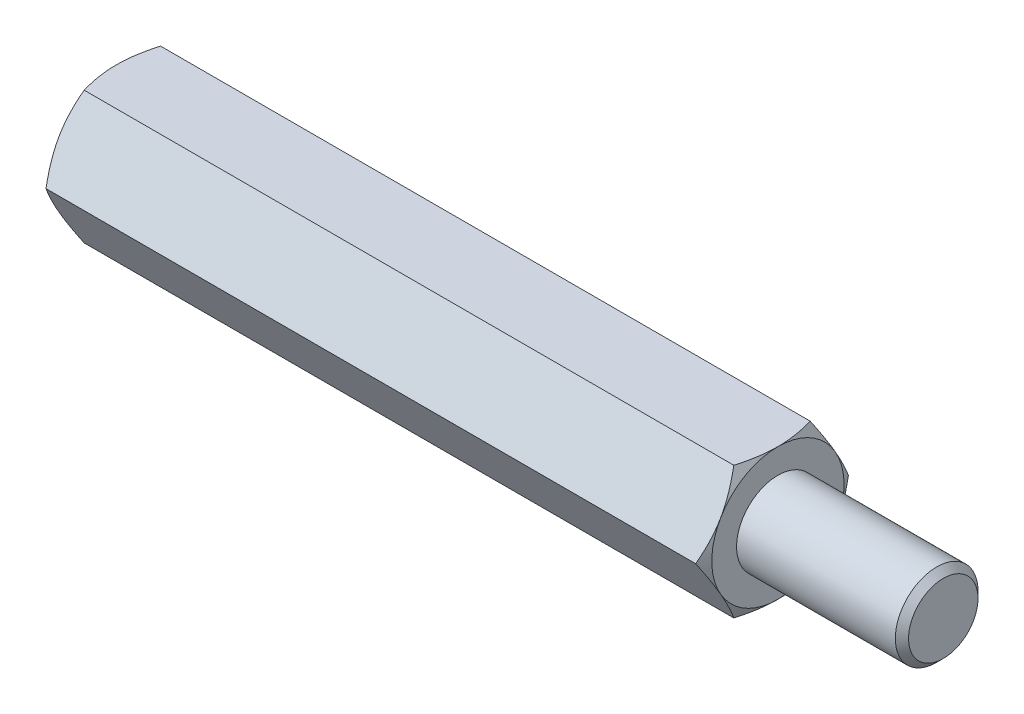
ISO-10303-21;
HEADER;
FILE_DESCRIPTION(('STEP AP214'),'2;1');
FILE_NAME('part.step','',(''),(''),'','','');
FILE_SCHEMA(('AUTOMOTIVE_DESIGN { 1 0 10303 214 1 1 1 1 }'));
ENDSEC;
DATA;
#1=APPLICATION_CONTEXT('core data for automotive mechanical design processes');
#2=APPLICATION_PROTOCOL_DEFINITION('international standard','automotive_design',2000,#1);
#3=PRODUCT_CONTEXT('',#1,'mechanical');
#4=PRODUCT('Part','Part','',(#3));
#5=PRODUCT_RELATED_PRODUCT_CATEGORY('part','',(#4));
#6=PRODUCT_DEFINITION_FORMATION('','',#4);
#7=PRODUCT_DEFINITION_CONTEXT('part definition',#1,'design');
#8=PRODUCT_DEFINITION('design','',#6,#7);
#9=PRODUCT_DEFINITION_SHAPE('','',#8);
#10=(LENGTH_UNIT() NAMED_UNIT(*) SI_UNIT(.MILLI.,.METRE.));
#11=(NAMED_UNIT(*) PLANE_ANGLE_UNIT() SI_UNIT($,.RADIAN.));
#12=(NAMED_UNIT(*) SI_UNIT($,.STERADIAN.) SOLID_ANGLE_UNIT());
#13=UNCERTAINTY_MEASURE_WITH_UNIT(LENGTH_MEASURE(1.E-05),#10,'distance_accuracy_value','');
#14=(GEOMETRIC_REPRESENTATION_CONTEXT(3) GLOBAL_UNCERTAINTY_ASSIGNED_CONTEXT((#13)) GLOBAL_UNIT_ASSIGNED_CONTEXT((#10,
#11,#12)) REPRESENTATION_CONTEXT('',''));
#15=CARTESIAN_POINT('',(0.,0.,0.));
#16=DIRECTION('',(0.,0.,1.));
#17=DIRECTION('',(1.,0.,0.));
#18=AXIS2_PLACEMENT_3D('',#15,#16,#17);
#19=CARTESIAN_POINT('',(20.,4.,-2.3094010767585));
#20=DIRECTION('',(1.,0.,0.));
#21=DIRECTION('',(0.,0.,-1.));
#22=AXIS2_PLACEMENT_3D('',#19,#20,#21);
#23=PLANE('',#22);
#24=CARTESIAN_POINT('',(20.,0.,0.));
#25=DIRECTION('',(1.,0.,0.));
#26=DIRECTION('',(0.,0.,-1.));
#27=AXIS2_PLACEMENT_3D('',#24,#25,#26);
#28=CIRCLE('',#27,4.);
#29=CARTESIAN_POINT('',(20.,-2.,-3.46410161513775));
#30=VERTEX_POINT('',#29);
#31=CARTESIAN_POINT('',(20.,2.,-3.46410161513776));
#32=VERTEX_POINT('',#31);
#33=EDGE_CURVE('E288',#30,#32,#28,.T.);
#34=ORIENTED_EDGE('',*,*,#33,.T.);
#35=CARTESIAN_POINT('',(20.,4.,0.));
#36=VERTEX_POINT('',#35);
#37=EDGE_CURVE('E53',#32,#36,#28,.T.);
#38=ORIENTED_EDGE('',*,*,#37,.T.);
#39=CARTESIAN_POINT('',(20.,2.,3.46410161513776));
#40=VERTEX_POINT('',#39);
#41=EDGE_CURVE('E297',#36,#40,#28,.T.);
#42=ORIENTED_EDGE('',*,*,#41,.T.);
#43=CARTESIAN_POINT('',(20.,-2.00000000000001,3.46410161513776));
#44=VERTEX_POINT('',#43);
#45=EDGE_CURVE('E302',#40,#44,#28,.T.);
#46=ORIENTED_EDGE('',*,*,#45,.T.);
#47=CARTESIAN_POINT('',(20.,0.,0.));
#48=DIRECTION('',(-1.,0.,0.));
#49=DIRECTION('',(0.,-1.,0.));
#50=AXIS2_PLACEMENT_3D('',#47,#48,#49);
#51=CIRCLE('',#50,4.);
#52=CARTESIAN_POINT('',(20.,-4.00000000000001,0.));
#53=VERTEX_POINT('',#52);
#54=EDGE_CURVE('E193',#53,#44,#51,.T.);
#55=ORIENTED_EDGE('',*,*,#54,.F.);
#56=EDGE_CURVE('E61',#53,#30,#28,.T.);
#57=ORIENTED_EDGE('',*,*,#56,.T.);
#58=EDGE_LOOP('',(#34,#38,#42,#46,#55,#57));
#59=FACE_BOUND('',#58,.T.);
#60=CARTESIAN_POINT('',(20.,0.,0.));
#61=DIRECTION('',(1.,0.,0.));
#62=DIRECTION('',(0.,0.,-1.));
#63=AXIS2_PLACEMENT_3D('',#60,#61,#62);
#64=CIRCLE('',#63,2.5);
#65=CARTESIAN_POINT('',(20.,0.,-2.5));
#66=VERTEX_POINT('',#65);
#67=EDGE_CURVE('E356',#66,#66,#64,.T.);
#68=ORIENTED_EDGE('',*,*,#67,.F.);
#69=EDGE_LOOP('',(#68));
#70=FACE_BOUND('',#69,.T.);
#71=ADVANCED_FACE('F37',(#59,#70),#23,.T.);
#72=CARTESIAN_POINT('',(20.,0.,-4.61880215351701));
#73=DIRECTION('',(0.,-0.5,0.866025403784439));
#74=DIRECTION('',(0.,-0.866025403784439,-0.5));
#75=AXIS2_PLACEMENT_3D('',#72,#73,#74);
#76=PLANE('',#75);
#77=CARTESIAN_POINT('',(19.6426677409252,-0.000200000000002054,-4.61891762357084));
#78=CARTESIAN_POINT('',(19.7012821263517,0.175579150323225,-4.51743148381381));
#79=CARTESIAN_POINT('',(19.7545896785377,0.352875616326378,-4.41506932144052));
#80=CARTESIAN_POINT('',(19.8476383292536,0.710538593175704,-4.20857250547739));
#81=CARTESIAN_POINT('',(19.8873465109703,0.890911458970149,-4.10443418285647));
#82=CARTESIAN_POINT('',(19.9491577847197,1.24942181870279,-3.89744813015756));
#83=CARTESIAN_POINT('',(19.9716722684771,1.42750415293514,-3.79463224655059));
#84=CARTESIAN_POINT('',(19.9985493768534,1.78450671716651,-3.58851671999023));
#85=CARTESIAN_POINT('',(20.0029342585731,1.9634256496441,-3.48521782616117));
#86=CARTESIAN_POINT('',(19.99380992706,2.29774284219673,-3.29219970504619));
#87=CARTESIAN_POINT('',(19.982541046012,2.45319115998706,-3.20245157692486));
#88=CARTESIAN_POINT('',(19.9468260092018,2.76307505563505,-3.02354002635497));
#89=CARTESIAN_POINT('',(19.9223676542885,2.91750956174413,-2.93437722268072));
#90=CARTESIAN_POINT('',(19.8612239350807,3.22803232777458,-2.75509682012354));
#91=CARTESIAN_POINT('',(19.8242793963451,3.3840812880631,-2.6650019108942));
#92=CARTESIAN_POINT('',(19.740429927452,3.69385183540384,-2.486155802));
#93=CARTESIAN_POINT('',(19.6935446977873,3.84757739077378,-2.39740231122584));
#94=CARTESIAN_POINT('',(19.6426677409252,4.0002,-2.30928560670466));
#95=B_SPLINE_CURVE_WITH_KNOTS('',3,(#77,#78,#79,#80,#81,#82,#83,#84,#85,#86,#87,#88,#89,#90,#91,
#92,#93,#94),.UNSPECIFIED.,.F.,.F.,(4,2,2,2,2,2,2,2,4),(0.,0.634047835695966,1.26961969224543,
1.88946157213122,2.50854226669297,3.04757825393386,3.58711366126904,4.13861653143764,
4.68903648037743),.UNSPECIFIED.);
#96=CARTESIAN_POINT('',(19.6427344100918,0.,-4.61880215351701));
#97=VERTEX_POINT('',#96);
#98=EDGE_CURVE('E314',#97,#32,#95,.T.);
#99=ORIENTED_EDGE('',*,*,#98,.F.);
#100=DIRECTION('',(-1.,0.,0.));
#101=VECTOR('',#100,1.);
#102=CARTESIAN_POINT('',(20.,0.,-4.61880215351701));
#103=LINE('',#102,#101);
#104=CARTESIAN_POINT('',(-19.6427344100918,0.,-4.61880215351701));
#105=VERTEX_POINT('',#104);
#106=EDGE_CURVE('E264',#97,#105,#103,.T.);
#107=ORIENTED_EDGE('',*,*,#106,.T.);
#108=CARTESIAN_POINT('',(-19.6426677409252,4.0002,-2.30928560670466));
#109=CARTESIAN_POINT('',(-19.7012821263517,3.82442084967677,-2.4107717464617));
#110=CARTESIAN_POINT('',(-19.7545896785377,3.64712438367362,-2.51313390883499));
#111=CARTESIAN_POINT('',(-19.8476383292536,3.28946140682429,-2.71963072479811));
#112=CARTESIAN_POINT('',(-19.8873465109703,3.10908854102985,-2.82376904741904));
#113=CARTESIAN_POINT('',(-19.9491577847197,2.75057818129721,-3.03075510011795));
#114=CARTESIAN_POINT('',(-19.9716722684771,2.57249584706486,-3.13357098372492));
#115=CARTESIAN_POINT('',(-19.9985493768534,2.21549328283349,-3.33968651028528));
#116=CARTESIAN_POINT('',(-20.0029342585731,2.0365743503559,-3.44298540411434));
#117=CARTESIAN_POINT('',(-19.99380992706,1.70225715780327,-3.63600352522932));
#118=CARTESIAN_POINT('',(-19.982541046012,1.54680884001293,-3.72575165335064));
#119=CARTESIAN_POINT('',(-19.9468260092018,1.23692494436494,-3.90466320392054));
#120=CARTESIAN_POINT('',(-19.9223676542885,1.08249043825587,-3.99382600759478));
#121=CARTESIAN_POINT('',(-19.8612239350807,0.77196767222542,-4.17310641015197));
#122=CARTESIAN_POINT('',(-19.8242793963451,0.615918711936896,-4.26320131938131));
#123=CARTESIAN_POINT('',(-19.740429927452,0.306148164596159,-4.4420474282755));
#124=CARTESIAN_POINT('',(-19.6935446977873,0.152422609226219,-4.53080091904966));
#125=CARTESIAN_POINT('',(-19.6426677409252,-0.000200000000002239,-4.61891762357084));
#126=B_SPLINE_CURVE_WITH_KNOTS('',3,(#108,#109,#110,#111,#112,#113,#114,#115,#116,#117,#118,
#119,#120,#121,#122,#123,#124,#125),.UNSPECIFIED.,.F.,.F.,(4,2,2,2,2,2,2,2,4),(0.,
0.634047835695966,1.26961969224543,1.88946157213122,2.50854226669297,3.04757825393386,
3.58711366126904,4.13861653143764,4.68903648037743),.UNSPECIFIED.);
#127=CARTESIAN_POINT('',(-20.,2.,-3.46410161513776));
#128=VERTEX_POINT('',#127);
#129=EDGE_CURVE('E365',#128,#105,#126,.T.);
#130=ORIENTED_EDGE('',*,*,#129,.F.);
#131=CARTESIAN_POINT('',(-19.6427344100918,4.,-2.3094010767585));
#132=VERTEX_POINT('',#131);
#133=EDGE_CURVE('E391',#132,#128,#126,.T.);
#134=ORIENTED_EDGE('',*,*,#133,.F.);
#135=DIRECTION('',(-1.,0.,0.));
#136=VECTOR('',#135,1.);
#137=CARTESIAN_POINT('',(20.,4.,-2.3094010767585));
#138=LINE('',#137,#136);
#139=CARTESIAN_POINT('',(19.642734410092,4.,-2.30940107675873));
#140=VERTEX_POINT('',#139);
#141=EDGE_CURVE('E279',#140,#132,#138,.T.);
#142=ORIENTED_EDGE('',*,*,#141,.F.);
#143=EDGE_CURVE('E229',#32,#140,#95,.T.);
#144=ORIENTED_EDGE('',*,*,#143,.F.);
#145=EDGE_LOOP('',(#99,#107,#130,#134,#142,#144));
#146=FACE_BOUND('',#145,.T.);
#147=ADVANCED_FACE('F148',(#146),#76,.F.);
#148=CARTESIAN_POINT('',(20.,4.,-2.3094010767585));
#149=DIRECTION('',(0.,-1.,0.));
#150=DIRECTION('',(0.,0.,-1.));
#151=AXIS2_PLACEMENT_3D('',#148,#149,#150);
#152=PLANE('',#151);
#153=CARTESIAN_POINT('',(18.0082907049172,4.,-6.28479524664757));
#154=CARTESIAN_POINT('',(18.0937006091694,4.,-6.10939349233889));
#155=CARTESIAN_POINT('',(18.1783148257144,4.,-5.93359774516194));
#156=CARTESIAN_POINT('',(18.3455059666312,4.,-5.58100905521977));
#157=CARTESIAN_POINT('',(18.4280825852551,4.,-5.40421596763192));
#158=CARTESIAN_POINT('',(18.5911508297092,4.,-5.04855089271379));
#159=CARTESIAN_POINT('',(18.6716293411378,4.,-4.86967287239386));
#160=CARTESIAN_POINT('',(18.829400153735,4.,-4.51052237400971));
#161=CARTESIAN_POINT('',(18.906692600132,4.,-4.33024995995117));
#162=CARTESIAN_POINT('',(19.059802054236,4.,-3.96189114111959));
#163=CARTESIAN_POINT('',(19.135480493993,4.,-3.77374683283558));
#164=CARTESIAN_POINT('',(19.2813045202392,4.,-3.39528725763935));
#165=CARTESIAN_POINT('',(19.3514494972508,4.,-3.2049717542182));
#166=CARTESIAN_POINT('',(19.4844245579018,4.,-2.82219775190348));
#167=CARTESIAN_POINT('',(19.5472687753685,4.,-2.62974421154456));
#168=CARTESIAN_POINT('',(19.6636796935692,4.,-2.24207725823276));
#169=CARTESIAN_POINT('',(19.7172492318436,4.,-2.04686470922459));
#170=CARTESIAN_POINT('',(19.8123031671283,4.,-1.65467425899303));
#171=CARTESIAN_POINT('',(19.8538563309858,4.,-1.45771333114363));
#172=CARTESIAN_POINT('',(19.9225903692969,4.,-1.06125849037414));
#173=CARTESIAN_POINT('',(19.9497727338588,4.,-0.861764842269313));
#174=CARTESIAN_POINT('',(19.9872447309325,4.,-0.463879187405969));
#175=CARTESIAN_POINT('',(19.9977578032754,4.,-0.265508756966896));
#176=CARTESIAN_POINT('',(20.0015934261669,4.,0.131417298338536));
#177=CARTESIAN_POINT('',(19.9949158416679,4.,0.329972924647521));
#178=CARTESIAN_POINT('',(19.9696489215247,4.,0.664692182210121));
#179=CARTESIAN_POINT('',(19.9553708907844,4.,0.801202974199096));
#180=CARTESIAN_POINT('',(19.9195349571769,4.,1.07327201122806));
#181=CARTESIAN_POINT('',(19.8979761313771,4.,1.20883013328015));
#182=CARTESIAN_POINT('',(19.8235066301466,4.,1.61386939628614));
#183=CARTESIAN_POINT('',(19.7608149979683,4.,1.8815748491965));
#184=CARTESIAN_POINT('',(19.6515117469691,4.,2.28197262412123));
#185=CARTESIAN_POINT('',(19.612009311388,4.,2.41672443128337));
#186=CARTESIAN_POINT('',(19.5287523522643,4.,2.68492067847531));
#187=CARTESIAN_POINT('',(19.4849977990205,4.,2.81836510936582));
#188=CARTESIAN_POINT('',(19.3939510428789,4.,3.08398596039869));
#189=CARTESIAN_POINT('',(19.346659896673,4.,3.21616274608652));
#190=CARTESIAN_POINT('',(19.2491111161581,4.,3.47941134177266));
#191=CARTESIAN_POINT('',(19.1988535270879,4.,3.61048316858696));
#192=CARTESIAN_POINT('',(19.0713295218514,4.,3.93385125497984));
#193=CARTESIAN_POINT('',(18.9926014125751,4.,4.1255702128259));
#194=CARTESIAN_POINT('',(18.8309693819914,4.,4.5072455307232));
#195=CARTESIAN_POINT('',(18.7480651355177,4.,4.69720175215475));
#196=CARTESIAN_POINT('',(18.5789699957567,4.,5.0756995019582));
#197=CARTESIAN_POINT('',(18.4927782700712,4.,5.264240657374));
#198=CARTESIAN_POINT('',(18.3178011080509,4.,5.64011758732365));
#199=CARTESIAN_POINT('',(18.2290156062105,4.,5.82745333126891));
#200=CARTESIAN_POINT('',(17.9593432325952,4.,6.38844423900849));
#201=CARTESIAN_POINT('',(17.7753561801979,4.,6.76060781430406));
#202=CARTESIAN_POINT('',(17.4019562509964,4.,7.50211228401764));
#203=CARTESIAN_POINT('',(17.2125442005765,4.,7.87145359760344));
#204=CARTESIAN_POINT('',(16.8473877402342,4.,8.57450173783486));
#205=CARTESIAN_POINT('',(16.671975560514,4.,8.90838144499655));
#206=CARTESIAN_POINT('',(16.3188097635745,4.,9.57491712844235));
#207=CARTESIAN_POINT('',(16.1410560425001,4.,9.9075730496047));
#208=CARTESIAN_POINT('',(15.7842933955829,4.,10.5709822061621));
#209=CARTESIAN_POINT('',(15.605289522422,3.99999999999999,10.9017381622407));
#210=CARTESIAN_POINT('',(15.2459071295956,3.99999999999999,11.5624752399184));
#211=CARTESIAN_POINT('',(15.0655286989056,3.99999999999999,11.8924564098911));
#212=CARTESIAN_POINT('',(14.884642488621,3.99999999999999,12.2221569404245));
#213=B_SPLINE_CURVE_WITH_KNOTS('',3,(#153,#154,#155,#156,#157,#158,#159,#160,#161,#162,#163,
#164,#165,#166,#167,#168,#169,#170,#171,#172,#173,#174,#175,#176,#177,#178,#179,#180,#181,#182,
#183,#184,#185,#186,#187,#188,#189,#190,#191,#192,#193,#194,#195,#196,#197,#198,#199,#200,#201,
#202,#203,#204,#205,#206,#207,#208,#209,#210,#211,#212),.UNSPECIFIED.,.F.,.F.,(4,2,2,2,2,2,2,2,
2,2,2,2,2,2,2,2,2,2,2,2,2,2,2,2,2,2,2,2,2,4),(0.,0.585280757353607,1.17064881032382,
1.75906864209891,2.34746162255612,2.95577704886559,3.56415938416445,4.17134357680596,
4.7783416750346,5.38179402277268,5.98518378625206,6.58041501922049,7.17565092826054,
7.5872191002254,7.99883946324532,8.82250155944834,9.24373134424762,9.66496407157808,
10.086071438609,10.5071723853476,11.1288656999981,11.7506074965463,12.3725077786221,
12.9944237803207,14.2398211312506,15.4850297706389,16.6164791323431,17.7479788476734,
18.8762380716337,20.0044248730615),.UNSPECIFIED.);
#214=EDGE_CURVE('E227',#140,#36,#213,.T.);
#215=ORIENTED_EDGE('',*,*,#214,.F.);
#216=ORIENTED_EDGE('',*,*,#141,.T.);
#217=CARTESIAN_POINT('',(-18.0082907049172,4.,-6.28479524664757));
#218=CARTESIAN_POINT('',(-18.0937006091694,4.,-6.10939349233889));
#219=CARTESIAN_POINT('',(-18.1783148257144,4.,-5.93359774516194));
#220=CARTESIAN_POINT('',(-18.3455059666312,4.,-5.58100905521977));
#221=CARTESIAN_POINT('',(-18.4280825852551,4.,-5.40421596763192));
#222=CARTESIAN_POINT('',(-18.5911508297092,4.,-5.04855089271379));
#223=CARTESIAN_POINT('',(-18.6716293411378,4.,-4.86967287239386));
#224=CARTESIAN_POINT('',(-18.829400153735,4.,-4.51052237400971));
#225=CARTESIAN_POINT('',(-18.906692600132,4.,-4.33024995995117));
#226=CARTESIAN_POINT('',(-19.059802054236,4.,-3.96189114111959));
#227=CARTESIAN_POINT('',(-19.135480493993,4.,-3.77374683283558));
#228=CARTESIAN_POINT('',(-19.2813045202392,4.,-3.39528725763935));
#229=CARTESIAN_POINT('',(-19.3514494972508,4.,-3.2049717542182));
#230=CARTESIAN_POINT('',(-19.4844245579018,4.,-2.82219775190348));
#231=CARTESIAN_POINT('',(-19.5472687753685,4.,-2.62974421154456));
#232=CARTESIAN_POINT('',(-19.6636796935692,4.,-2.24207725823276));
#233=CARTESIAN_POINT('',(-19.7172492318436,4.,-2.04686470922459));
#234=CARTESIAN_POINT('',(-19.8123031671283,4.,-1.65467425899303));
#235=CARTESIAN_POINT('',(-19.8538563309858,4.,-1.45771333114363));
#236=CARTESIAN_POINT('',(-19.9225903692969,4.,-1.06125849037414));
#237=CARTESIAN_POINT('',(-19.9497727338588,4.,-0.861764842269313));
#238=CARTESIAN_POINT('',(-19.9872447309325,4.,-0.463879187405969));
#239=CARTESIAN_POINT('',(-19.9977578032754,4.,-0.265508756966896));
#240=CARTESIAN_POINT('',(-20.0015934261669,4.,0.131417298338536));
#241=CARTESIAN_POINT('',(-19.9949158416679,4.,0.329972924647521));
#242=CARTESIAN_POINT('',(-19.9696489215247,4.,0.664692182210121));
#243=CARTESIAN_POINT('',(-19.9553708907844,4.,0.801202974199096));
#244=CARTESIAN_POINT('',(-19.9195349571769,4.,1.07327201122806));
#245=CARTESIAN_POINT('',(-19.8979761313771,4.,1.20883013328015));
#246=CARTESIAN_POINT('',(-19.8235066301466,4.,1.61386939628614));
#247=CARTESIAN_POINT('',(-19.7608149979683,4.,1.8815748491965));
#248=CARTESIAN_POINT('',(-19.6515117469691,4.,2.28197262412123));
#249=CARTESIAN_POINT('',(-19.612009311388,4.,2.41672443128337));
#250=CARTESIAN_POINT('',(-19.5287523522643,4.,2.68492067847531));
#251=CARTESIAN_POINT('',(-19.4849977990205,4.,2.81836510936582));
#252=CARTESIAN_POINT('',(-19.3939510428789,4.,3.08398596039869));
#253=CARTESIAN_POINT('',(-19.346659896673,4.,3.21616274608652));
#254=CARTESIAN_POINT('',(-19.2491111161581,4.,3.47941134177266));
#255=CARTESIAN_POINT('',(-19.1988535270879,4.,3.61048316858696));
#256=CARTESIAN_POINT('',(-19.0713295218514,4.,3.93385125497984));
#257=CARTESIAN_POINT('',(-18.9926014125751,4.,4.1255702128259));
#258=CARTESIAN_POINT('',(-18.8309693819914,4.,4.5072455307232));
#259=CARTESIAN_POINT('',(-18.7480651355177,4.,4.69720175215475));
#260=CARTESIAN_POINT('',(-18.5789699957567,4.,5.0756995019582));
#261=CARTESIAN_POINT('',(-18.4927782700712,4.,5.264240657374));
#262=CARTESIAN_POINT('',(-18.3178011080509,4.,5.64011758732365));
#263=CARTESIAN_POINT('',(-18.2290156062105,4.,5.82745333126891));
#264=CARTESIAN_POINT('',(-17.9593432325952,4.,6.38844423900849));
#265=CARTESIAN_POINT('',(-17.7753561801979,4.,6.76060781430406));
#266=CARTESIAN_POINT('',(-17.4019562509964,4.,7.50211228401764));
#267=CARTESIAN_POINT('',(-17.2125442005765,4.,7.87145359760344));
#268=CARTESIAN_POINT('',(-16.8473877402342,4.,8.57450173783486));
#269=CARTESIAN_POINT('',(-16.671975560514,4.,8.90838144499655));
#270=CARTESIAN_POINT('',(-16.3188097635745,4.,9.57491712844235));
#271=CARTESIAN_POINT('',(-16.1410560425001,4.,9.9075730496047));
#272=CARTESIAN_POINT('',(-15.7842933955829,4.,10.5709822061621));
#273=CARTESIAN_POINT('',(-15.605289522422,3.99999999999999,10.9017381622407));
#274=CARTESIAN_POINT('',(-15.2459071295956,3.99999999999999,11.5624752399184));
#275=CARTESIAN_POINT('',(-15.0655286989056,3.99999999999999,11.8924564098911));
#276=CARTESIAN_POINT('',(-14.884642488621,3.99999999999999,12.2221569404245));
#277=B_SPLINE_CURVE_WITH_KNOTS('',3,(#217,#218,#219,#220,#221,#222,#223,#224,#225,#226,#227,
#228,#229,#230,#231,#232,#233,#234,#235,#236,#237,#238,#239,#240,#241,#242,#243,#244,#245,#246,
#247,#248,#249,#250,#251,#252,#253,#254,#255,#256,#257,#258,#259,#260,#261,#262,#263,#264,#265,
#266,#267,#268,#269,#270,#271,#272,#273,#274,#275,#276),.UNSPECIFIED.,.F.,.F.,(4,2,2,2,2,2,2,2,
2,2,2,2,2,2,2,2,2,2,2,2,2,2,2,2,2,2,2,2,2,4),(0.,0.585280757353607,1.17064881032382,
1.75906864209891,2.34746162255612,2.95577704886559,3.56415938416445,4.17134357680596,
4.7783416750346,5.38179402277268,5.98518378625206,6.58041501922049,7.17565092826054,
7.5872191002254,7.99883946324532,8.82250155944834,9.24373134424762,9.66496407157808,
10.086071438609,10.5071723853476,11.1288656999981,11.7506074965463,12.3725077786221,
12.9944237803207,14.2398211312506,15.4850297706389,16.6164791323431,17.7479788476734,
18.8762380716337,20.0044248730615),.UNSPECIFIED.);
#278=CARTESIAN_POINT('',(-20.,4.,0.));
#279=VERTEX_POINT('',#278);
#280=EDGE_CURVE('E241',#279,#132,#277,.F.);
#281=ORIENTED_EDGE('',*,*,#280,.F.);
#282=CARTESIAN_POINT('',(-19.6427344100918,4.,2.3094010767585));
#283=VERTEX_POINT('',#282);
#284=EDGE_CURVE('E249',#283,#279,#277,.F.);
#285=ORIENTED_EDGE('',*,*,#284,.F.);
#286=DIRECTION('',(-1.,0.,0.));
#287=VECTOR('',#286,1.);
#288=CARTESIAN_POINT('',(20.,4.,2.3094010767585));
#289=LINE('',#288,#287);
#290=CARTESIAN_POINT('',(19.6427344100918,4.,2.3094010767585));
#291=VERTEX_POINT('',#290);
#292=EDGE_CURVE('E276',#291,#283,#289,.T.);
#293=ORIENTED_EDGE('',*,*,#292,.F.);
#294=EDGE_CURVE('E221',#36,#291,#213,.T.);
#295=ORIENTED_EDGE('',*,*,#294,.F.);
#296=EDGE_LOOP('',(#215,#216,#281,#285,#293,#295));
#297=FACE_BOUND('',#296,.T.);
#298=ADVANCED_FACE('F153',(#297),#152,.F.);
#299=CARTESIAN_POINT('',(20.,4.,2.3094010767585));
#300=DIRECTION('',(0.,-0.5,-0.866025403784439));
#301=DIRECTION('',(0.,0.866025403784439,-0.5));
#302=AXIS2_PLACEMENT_3D('',#299,#300,#301);
#303=PLANE('',#302);
#304=CARTESIAN_POINT('',(19.6426677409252,4.0002,2.30928560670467));
#305=CARTESIAN_POINT('',(19.7012821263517,3.82442084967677,2.4107717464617));
#306=CARTESIAN_POINT('',(19.7545896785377,3.64712438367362,2.51313390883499));
#307=CARTESIAN_POINT('',(19.8476383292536,3.28946140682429,2.71963072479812));
#308=CARTESIAN_POINT('',(19.8873465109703,3.10908854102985,2.82376904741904));
#309=CARTESIAN_POINT('',(19.9491577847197,2.75057818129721,3.03075510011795));
#310=CARTESIAN_POINT('',(19.9716722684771,2.57249584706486,3.13357098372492));
#311=CARTESIAN_POINT('',(19.9985493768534,2.21549328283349,3.33968651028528));
#312=CARTESIAN_POINT('',(20.0029342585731,2.0365743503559,3.44298540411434));
#313=CARTESIAN_POINT('',(19.99380992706,1.70225715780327,3.63600352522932));
#314=CARTESIAN_POINT('',(19.982541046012,1.54680884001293,3.72575165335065));
#315=CARTESIAN_POINT('',(19.9468260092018,1.23692494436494,3.90466320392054));
#316=CARTESIAN_POINT('',(19.9223676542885,1.08249043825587,3.99382600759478));
#317=CARTESIAN_POINT('',(19.8612239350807,0.771967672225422,4.17310641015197));
#318=CARTESIAN_POINT('',(19.8242793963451,0.615918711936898,4.26320131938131));
#319=CARTESIAN_POINT('',(19.740429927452,0.306148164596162,4.4420474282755));
#320=CARTESIAN_POINT('',(19.6935446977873,0.152422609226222,4.53080091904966));
#321=CARTESIAN_POINT('',(19.6426677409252,-0.000199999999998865,4.61891762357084));
#322=B_SPLINE_CURVE_WITH_KNOTS('',3,(#304,#305,#306,#307,#308,#309,#310,#311,#312,#313,#314,
#315,#316,#317,#318,#319,#320,#321),.UNSPECIFIED.,.F.,.F.,(4,2,2,2,2,2,2,2,4),(0.,
0.634047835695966,1.26961969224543,1.88946157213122,2.50854226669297,3.04757825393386,
3.58711366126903,4.13861653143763,4.68903648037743),.UNSPECIFIED.);
#323=EDGE_CURVE('E228',#291,#40,#322,.T.);
#324=ORIENTED_EDGE('',*,*,#323,.F.);
#325=ORIENTED_EDGE('',*,*,#292,.T.);
#326=CARTESIAN_POINT('',(-19.6426677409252,-0.000199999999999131,4.61891762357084));
#327=CARTESIAN_POINT('',(-19.7012821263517,0.175579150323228,4.5174314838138));
#328=CARTESIAN_POINT('',(-19.7545896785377,0.352875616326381,4.41506932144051));
#329=CARTESIAN_POINT('',(-19.8476383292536,0.710538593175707,4.20857250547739));
#330=CARTESIAN_POINT('',(-19.8873465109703,0.890911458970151,4.10443418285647));
#331=CARTESIAN_POINT('',(-19.9491577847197,1.24942181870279,3.89744813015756));
#332=CARTESIAN_POINT('',(-19.9716722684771,1.42750415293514,3.79463224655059));
#333=CARTESIAN_POINT('',(-19.9985493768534,1.78450671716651,3.58851671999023));
#334=CARTESIAN_POINT('',(-20.0029342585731,1.9634256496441,3.48521782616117));
#335=CARTESIAN_POINT('',(-19.99380992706,2.29774284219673,3.29219970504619));
#336=CARTESIAN_POINT('',(-19.982541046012,2.45319115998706,3.20245157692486));
#337=CARTESIAN_POINT('',(-19.9468260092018,2.76307505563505,3.02354002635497));
#338=CARTESIAN_POINT('',(-19.9223676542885,2.91750956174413,2.93437722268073));
#339=CARTESIAN_POINT('',(-19.8612239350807,3.22803232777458,2.75509682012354));
#340=CARTESIAN_POINT('',(-19.8242793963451,3.3840812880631,2.6650019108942));
#341=CARTESIAN_POINT('',(-19.740429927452,3.69385183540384,2.48615580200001));
#342=CARTESIAN_POINT('',(-19.6935446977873,3.84757739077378,2.39740231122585));
#343=CARTESIAN_POINT('',(-19.6426677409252,4.0002,2.30928560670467));
#344=B_SPLINE_CURVE_WITH_KNOTS('',3,(#326,#327,#328,#329,#330,#331,#332,#333,#334,#335,#336,
#337,#338,#339,#340,#341,#342,#343),.UNSPECIFIED.,.F.,.F.,(4,2,2,2,2,2,2,2,4),(0.,
0.634047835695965,1.26961969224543,1.88946157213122,2.50854226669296,3.04757825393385,
3.58711366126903,4.13861653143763,4.68903648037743),.UNSPECIFIED.);
#345=CARTESIAN_POINT('',(-20.,2.,3.46410161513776));
#346=VERTEX_POINT('',#345);
#347=EDGE_CURVE('E255',#346,#283,#344,.T.);
#348=ORIENTED_EDGE('',*,*,#347,.F.);
#349=CARTESIAN_POINT('',(-19.6427344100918,0.,4.618802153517));
#350=VERTEX_POINT('',#349);
#351=EDGE_CURVE('E262',#350,#346,#344,.T.);
#352=ORIENTED_EDGE('',*,*,#351,.F.);
#353=DIRECTION('',(-1.,0.,0.));
#354=VECTOR('',#353,1.);
#355=CARTESIAN_POINT('',(20.,0.,4.618802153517));
#356=LINE('',#355,#354);
#357=CARTESIAN_POINT('',(19.6427344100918,0.,4.618802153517));
#358=VERTEX_POINT('',#357);
#359=EDGE_CURVE('E273',#358,#350,#356,.T.);
#360=ORIENTED_EDGE('',*,*,#359,.F.);
#361=EDGE_CURVE('E215',#40,#358,#322,.T.);
#362=ORIENTED_EDGE('',*,*,#361,.F.);
#363=EDGE_LOOP('',(#324,#325,#348,#352,#360,#362));
#364=FACE_BOUND('',#363,.T.);
#365=ADVANCED_FACE('F235',(#364),#303,.F.);
#366=CARTESIAN_POINT('',(20.,0.,4.618802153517));
#367=DIRECTION('',(0.,0.5,-0.866025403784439));
#368=DIRECTION('',(0.,0.866025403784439,0.5));
#369=AXIS2_PLACEMENT_3D('',#366,#367,#368);
#370=PLANE('',#369);
#371=CARTESIAN_POINT('',(19.6426677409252,0.000200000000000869,4.61891762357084));
#372=CARTESIAN_POINT('',(19.7012821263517,-0.175579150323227,4.5174314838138));
#373=CARTESIAN_POINT('',(19.7545896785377,-0.35287561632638,4.41506932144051));
#374=CARTESIAN_POINT('',(19.8476383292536,-0.710538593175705,4.20857250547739));
#375=CARTESIAN_POINT('',(19.8873465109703,-0.890911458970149,4.10443418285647));
#376=CARTESIAN_POINT('',(19.9491577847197,-1.24942181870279,3.89744813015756));
#377=CARTESIAN_POINT('',(19.9716722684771,-1.42750415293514,3.79463224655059));
#378=CARTESIAN_POINT('',(19.9985493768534,-1.78450671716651,3.58851671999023));
#379=CARTESIAN_POINT('',(20.0029342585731,-1.9634256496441,3.48521782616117));
#380=CARTESIAN_POINT('',(19.99380992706,-2.29774284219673,3.29219970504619));
#381=CARTESIAN_POINT('',(19.982541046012,-2.45319115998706,3.20245157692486));
#382=CARTESIAN_POINT('',(19.9468260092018,-2.76307505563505,3.02354002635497));
#383=CARTESIAN_POINT('',(19.9223676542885,-2.91750956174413,2.93437722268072));
#384=CARTESIAN_POINT('',(19.8612239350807,-3.22803232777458,2.75509682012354));
#385=CARTESIAN_POINT('',(19.8242793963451,-3.3840812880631,2.6650019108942));
#386=CARTESIAN_POINT('',(19.740429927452,-3.69385183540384,2.48615580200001));
#387=CARTESIAN_POINT('',(19.6935446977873,-3.84757739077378,2.39740231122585));
#388=CARTESIAN_POINT('',(19.6426677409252,-4.0002,2.30928560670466));
#389=B_SPLINE_CURVE_WITH_KNOTS('',3,(#371,#372,#373,#374,#375,#376,#377,#378,#379,#380,#381,
#382,#383,#384,#385,#386,#387,#388),.UNSPECIFIED.,.F.,.F.,(4,2,2,2,2,2,2,2,4),(0.,
0.634047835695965,1.26961969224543,1.88946157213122,2.50854226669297,3.04757825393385,
3.58711366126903,4.13861653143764,4.68903648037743),.UNSPECIFIED.);
#390=EDGE_CURVE('E338',#358,#44,#389,.T.);
#391=ORIENTED_EDGE('',*,*,#390,.F.);
#392=ORIENTED_EDGE('',*,*,#359,.T.);
#393=CARTESIAN_POINT('',(-19.6426677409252,-4.0002,2.30928560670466));
#394=CARTESIAN_POINT('',(-19.7012821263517,-3.82442084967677,2.4107717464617));
#395=CARTESIAN_POINT('',(-19.7545896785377,-3.64712438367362,2.51313390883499));
#396=CARTESIAN_POINT('',(-19.8476383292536,-3.28946140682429,2.71963072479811));
#397=CARTESIAN_POINT('',(-19.8873465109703,-3.10908854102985,2.82376904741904));
#398=CARTESIAN_POINT('',(-19.9491577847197,-2.75057818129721,3.03075510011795));
#399=CARTESIAN_POINT('',(-19.9716722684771,-2.57249584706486,3.13357098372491));
#400=CARTESIAN_POINT('',(-19.9985493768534,-2.21549328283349,3.33968651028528));
#401=CARTESIAN_POINT('',(-20.0029342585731,-2.0365743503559,3.44298540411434));
#402=CARTESIAN_POINT('',(-19.99380992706,-1.70225715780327,3.63600352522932));
#403=CARTESIAN_POINT('',(-19.982541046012,-1.54680884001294,3.72575165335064));
#404=CARTESIAN_POINT('',(-19.9468260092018,-1.23692494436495,3.90466320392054));
#405=CARTESIAN_POINT('',(-19.9223676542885,-1.08249043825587,3.99382600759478));
#406=CARTESIAN_POINT('',(-19.8612239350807,-0.771967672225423,4.17310641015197));
#407=CARTESIAN_POINT('',(-19.8242793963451,-0.615918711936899,4.26320131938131));
#408=CARTESIAN_POINT('',(-19.740429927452,-0.306148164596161,4.4420474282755));
#409=CARTESIAN_POINT('',(-19.6935446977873,-0.15242260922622,4.53080091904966));
#410=CARTESIAN_POINT('',(-19.6426677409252,0.000200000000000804,4.61891762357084));
#411=B_SPLINE_CURVE_WITH_KNOTS('',3,(#393,#394,#395,#396,#397,#398,#399,#400,#401,#402,#403,
#404,#405,#406,#407,#408,#409,#410),.UNSPECIFIED.,.F.,.F.,(4,2,2,2,2,2,2,2,4),(0.,
0.634047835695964,1.26961969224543,1.88946157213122,2.50854226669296,3.04757825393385,
3.58711366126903,4.13861653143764,4.68903648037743),.UNSPECIFIED.);
#412=CARTESIAN_POINT('',(-20.,-2.00000000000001,3.46410161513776));
#413=VERTEX_POINT('',#412);
#414=EDGE_CURVE('E263',#413,#350,#411,.T.);
#415=ORIENTED_EDGE('',*,*,#414,.F.);
#416=CARTESIAN_POINT('',(-19.6427344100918,-4.,2.3094010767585));
#417=VERTEX_POINT('',#416);
#418=EDGE_CURVE('E250',#417,#413,#411,.T.);
#419=ORIENTED_EDGE('',*,*,#418,.F.);
#420=DIRECTION('',(-1.,0.,0.));
#421=VECTOR('',#420,1.);
#422=CARTESIAN_POINT('',(20.,-4.,2.3094010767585));
#423=LINE('',#422,#421);
#424=CARTESIAN_POINT('',(19.6427344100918,-4.,2.3094010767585));
#425=VERTEX_POINT('',#424);
#426=EDGE_CURVE('E270',#425,#417,#423,.T.);
#427=ORIENTED_EDGE('',*,*,#426,.F.);
#428=EDGE_CURVE('E210',#44,#425,#389,.T.);
#429=ORIENTED_EDGE('',*,*,#428,.F.);
#430=EDGE_LOOP('',(#391,#392,#415,#419,#427,#429));
#431=FACE_BOUND('',#430,.T.);
#432=ADVANCED_FACE('F446',(#431),#370,.F.);
#433=CARTESIAN_POINT('',(20.,-4.,2.3094010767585));
#434=DIRECTION('',(0.,1.,0.));
#435=DIRECTION('',(0.,0.,1.));
#436=AXIS2_PLACEMENT_3D('',#433,#434,#435);
#437=PLANE('',#436);
#438=CARTESIAN_POINT('',(18.0082907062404,-4.,-6.28479524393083));
#439=CARTESIAN_POINT('',(18.0937006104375,-4.,-6.10939348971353));
#440=CARTESIAN_POINT('',(18.1783148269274,-4.,-5.93359774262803));
#441=CARTESIAN_POINT('',(18.3455059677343,-4.,-5.58100905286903));
#442=CARTESIAN_POINT('',(18.4280825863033,-4.,-5.40421596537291));
#443=CARTESIAN_POINT('',(18.5911508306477,-4.,-5.04855089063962));
#444=CARTESIAN_POINT('',(18.6716293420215,-4.,-4.86967287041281));
#445=CARTESIAN_POINT('',(18.8294001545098,-4.,-4.51052237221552));
#446=CARTESIAN_POINT('',(18.9066926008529,-4.,-4.33024995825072));
#447=CARTESIAN_POINT('',(19.0598020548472,-4.,-3.96189113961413));
#448=CARTESIAN_POINT('',(19.1354804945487,-4.,-3.77374683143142));
#449=CARTESIAN_POINT('',(19.2813045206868,-4.,-3.39528725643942));
#450=CARTESIAN_POINT('',(19.3514494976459,-4.,-3.2049717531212));
#451=CARTESIAN_POINT('',(19.4844245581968,-4.,-2.82219775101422));
#452=CARTESIAN_POINT('',(19.5472687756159,-4.,-2.62974421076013));
#453=CARTESIAN_POINT('',(19.6636796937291,-4.,-2.24207725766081));
#454=CARTESIAN_POINT('',(19.7172492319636,-4.,-2.04686470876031));
#455=CARTESIAN_POINT('',(19.8123031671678,-4.,-1.65467425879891));
#456=CARTESIAN_POINT('',(19.8538563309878,-4.,-1.45771333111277));
#457=CARTESIAN_POINT('',(19.9225903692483,-4.,-1.06125849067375));
#458=CARTESIAN_POINT('',(19.9497727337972,-4.,-0.861764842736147));
#459=CARTESIAN_POINT('',(19.9872447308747,-4.,-0.463879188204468));
#460=CARTESIAN_POINT('',(19.9977578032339,-4.,-0.265508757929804));
#461=CARTESIAN_POINT('',(20.0015934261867,-4.,0.131417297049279));
#462=CARTESIAN_POINT('',(19.9949158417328,-4.,0.329972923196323));
#463=CARTESIAN_POINT('',(19.9696489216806,-4.,0.664692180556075));
#464=CARTESIAN_POINT('',(19.9553708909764,-4.,0.801202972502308));
#465=CARTESIAN_POINT('',(19.9195349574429,-4.,1.07327200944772));
#466=CARTESIAN_POINT('',(19.8979761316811,-4.,1.20883013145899));
#467=CARTESIAN_POINT('',(19.8235066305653,-4.,1.6138693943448));
#468=CARTESIAN_POINT('',(19.7608149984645,-4.,1.88157484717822));
#469=CARTESIAN_POINT('',(19.6515117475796,-4.,2.28197262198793));
#470=CARTESIAN_POINT('',(19.6120093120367,-4.,2.41672442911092));
#471=CARTESIAN_POINT('',(19.5287523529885,-4.,2.68492067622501));
#472=CARTESIAN_POINT('',(19.4849977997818,-4.,2.81836510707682));
#473=CARTESIAN_POINT('',(19.3939510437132,-4.,3.08398595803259));
#474=CARTESIAN_POINT('',(19.3466598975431,-4.,3.216162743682));
#475=CARTESIAN_POINT('',(19.2491111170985,-4.,3.47941133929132));
#476=CARTESIAN_POINT('',(19.1988535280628,-4.,3.6104831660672));
#477=CARTESIAN_POINT('',(19.0713295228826,-4.,3.93385125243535));
#478=CARTESIAN_POINT('',(18.9926014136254,-4.,4.12557021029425));
#479=CARTESIAN_POINT('',(18.830969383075,-4.,4.5072455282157));
#480=CARTESIAN_POINT('',(18.7480651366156,-4.,4.69720174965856));
#481=CARTESIAN_POINT('',(18.5789699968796,-4.,5.07569949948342));
#482=CARTESIAN_POINT('',(18.4927782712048,-4.,5.26424065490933));
#483=CARTESIAN_POINT('',(18.3178011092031,-4.,5.64011758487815));
#484=CARTESIAN_POINT('',(18.2290156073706,-4.,5.82745332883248));
#485=CARTESIAN_POINT('',(17.9593432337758,-4.,6.3884442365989));
#486=CARTESIAN_POINT('',(17.775356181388,-4.,6.76060781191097));
#487=CARTESIAN_POINT('',(17.4019562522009,-4.,7.50211228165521));
#488=CARTESIAN_POINT('',(17.2125442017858,-4.,7.87145359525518));
#489=CARTESIAN_POINT('',(16.8473877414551,-4.,8.5745017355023));
#490=CARTESIAN_POINT('',(16.671975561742,-4.,8.90838144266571));
#491=CARTESIAN_POINT('',(16.3188097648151,-4.,9.5749171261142));
#492=CARTESIAN_POINT('',(16.1410560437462,-4.,9.90757304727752));
#493=CARTESIAN_POINT('',(15.78429339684,-4.,10.5709822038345));
#494=CARTESIAN_POINT('',(15.6052895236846,-4.,10.9017381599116));
#495=CARTESIAN_POINT('',(15.2459071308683,-4.,11.562475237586));
#496=CARTESIAN_POINT('',(15.065528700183,-4.,11.8924564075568));
#497=CARTESIAN_POINT('',(14.8846424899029,-4.,12.2221569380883));
#498=B_SPLINE_CURVE_WITH_KNOTS('',3,(#438,#439,#440,#441,#442,#443,#444,#445,#446,#447,#448,
#449,#450,#451,#452,#453,#454,#455,#456,#457,#458,#459,#460,#461,#462,#463,#464,#465,#466,#467,
#468,#469,#470,#471,#472,#473,#474,#475,#476,#477,#478,#479,#480,#481,#482,#483,#484,#485,#486,
#487,#488,#489,#490,#491,#492,#493,#494,#495,#496,#497),.UNSPECIFIED.,.F.,.F.,(4,2,2,2,2,2,2,2,
2,2,2,2,2,2,2,2,2,2,2,2,2,2,2,2,2,2,2,2,2,4),(0.,0.585280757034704,1.17064880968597,
1.75906864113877,2.34746162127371,2.95577704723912,3.56415938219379,4.17134357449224,
4.77834167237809,5.38179401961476,5.98518378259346,6.58041501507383,7.1756509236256,
7.5872190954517,7.99883945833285,8.82250155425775,9.24373133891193,9.6649640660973,
10.0860714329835,10.5071723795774,11.1288656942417,11.7506074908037,12.3725077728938,
12.9944237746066,14.2398211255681,15.4850297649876,16.6164791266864,17.7479788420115,
18.8762380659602,20.0044248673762),.UNSPECIFIED.);
#499=EDGE_CURVE('E346',#425,#53,#498,.F.);
#500=ORIENTED_EDGE('',*,*,#499,.F.);
#501=ORIENTED_EDGE('',*,*,#426,.T.);
#502=CARTESIAN_POINT('',(-18.0082907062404,-4.,-6.28479524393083));
#503=CARTESIAN_POINT('',(-18.0937006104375,-4.,-6.10939348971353));
#504=CARTESIAN_POINT('',(-18.1783148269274,-4.,-5.93359774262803));
#505=CARTESIAN_POINT('',(-18.3455059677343,-4.,-5.58100905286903));
#506=CARTESIAN_POINT('',(-18.4280825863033,-4.,-5.40421596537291));
#507=CARTESIAN_POINT('',(-18.5911508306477,-4.,-5.04855089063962));
#508=CARTESIAN_POINT('',(-18.6716293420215,-4.,-4.86967287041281));
#509=CARTESIAN_POINT('',(-18.8294001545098,-4.,-4.51052237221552));
#510=CARTESIAN_POINT('',(-18.9066926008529,-4.,-4.33024995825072));
#511=CARTESIAN_POINT('',(-19.0598020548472,-4.,-3.96189113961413));
#512=CARTESIAN_POINT('',(-19.1354804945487,-4.,-3.77374683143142));
#513=CARTESIAN_POINT('',(-19.2813045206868,-4.,-3.39528725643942));
#514=CARTESIAN_POINT('',(-19.3514494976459,-4.,-3.2049717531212));
#515=CARTESIAN_POINT('',(-19.4844245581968,-4.,-2.82219775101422));
#516=CARTESIAN_POINT('',(-19.5472687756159,-4.,-2.62974421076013));
#517=CARTESIAN_POINT('',(-19.6636796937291,-4.,-2.24207725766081));
#518=CARTESIAN_POINT('',(-19.7172492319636,-4.,-2.04686470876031));
#519=CARTESIAN_POINT('',(-19.8123031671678,-4.,-1.65467425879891));
#520=CARTESIAN_POINT('',(-19.8538563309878,-4.,-1.45771333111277));
#521=CARTESIAN_POINT('',(-19.9225903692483,-4.,-1.06125849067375));
#522=CARTESIAN_POINT('',(-19.9497727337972,-4.,-0.861764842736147));
#523=CARTESIAN_POINT('',(-19.9872447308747,-4.,-0.463879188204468));
#524=CARTESIAN_POINT('',(-19.9977578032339,-4.,-0.265508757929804));
#525=CARTESIAN_POINT('',(-20.0015934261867,-4.,0.131417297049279));
#526=CARTESIAN_POINT('',(-19.9949158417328,-4.,0.329972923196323));
#527=CARTESIAN_POINT('',(-19.9696489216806,-4.,0.664692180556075));
#528=CARTESIAN_POINT('',(-19.9553708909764,-4.,0.801202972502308));
#529=CARTESIAN_POINT('',(-19.9195349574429,-4.,1.07327200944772));
#530=CARTESIAN_POINT('',(-19.8979761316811,-4.,1.20883013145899));
#531=CARTESIAN_POINT('',(-19.8235066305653,-4.,1.6138693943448));
#532=CARTESIAN_POINT('',(-19.7608149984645,-4.,1.88157484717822));
#533=CARTESIAN_POINT('',(-19.6515117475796,-4.,2.28197262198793));
#534=CARTESIAN_POINT('',(-19.6120093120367,-4.,2.41672442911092));
#535=CARTESIAN_POINT('',(-19.5287523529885,-4.,2.68492067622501));
#536=CARTESIAN_POINT('',(-19.4849977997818,-4.,2.81836510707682));
#537=CARTESIAN_POINT('',(-19.3939510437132,-4.,3.08398595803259));
#538=CARTESIAN_POINT('',(-19.3466598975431,-4.,3.216162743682));
#539=CARTESIAN_POINT('',(-19.2491111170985,-4.,3.47941133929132));
#540=CARTESIAN_POINT('',(-19.1988535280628,-4.,3.6104831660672));
#541=CARTESIAN_POINT('',(-19.0713295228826,-4.,3.93385125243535));
#542=CARTESIAN_POINT('',(-18.9926014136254,-4.,4.12557021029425));
#543=CARTESIAN_POINT('',(-18.830969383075,-4.,4.5072455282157));
#544=CARTESIAN_POINT('',(-18.7480651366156,-4.,4.69720174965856));
#545=CARTESIAN_POINT('',(-18.5789699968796,-4.,5.07569949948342));
#546=CARTESIAN_POINT('',(-18.4927782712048,-4.,5.26424065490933));
#547=CARTESIAN_POINT('',(-18.3178011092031,-4.,5.64011758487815));
#548=CARTESIAN_POINT('',(-18.2290156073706,-4.,5.82745332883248));
#549=CARTESIAN_POINT('',(-17.9593432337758,-4.,6.3884442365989));
#550=CARTESIAN_POINT('',(-17.775356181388,-4.,6.76060781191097));
#551=CARTESIAN_POINT('',(-17.4019562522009,-4.,7.50211228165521));
#552=CARTESIAN_POINT('',(-17.2125442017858,-4.,7.87145359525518));
#553=CARTESIAN_POINT('',(-16.8473877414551,-4.,8.5745017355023));
#554=CARTESIAN_POINT('',(-16.671975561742,-4.,8.90838144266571));
#555=CARTESIAN_POINT('',(-16.3188097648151,-4.,9.5749171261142));
#556=CARTESIAN_POINT('',(-16.1410560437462,-4.,9.90757304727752));
#557=CARTESIAN_POINT('',(-15.78429339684,-4.,10.5709822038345));
#558=CARTESIAN_POINT('',(-15.6052895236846,-4.,10.9017381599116));
#559=CARTESIAN_POINT('',(-15.2459071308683,-4.,11.562475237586));
#560=CARTESIAN_POINT('',(-15.065528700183,-4.,11.8924564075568));
#561=CARTESIAN_POINT('',(-14.8846424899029,-4.,12.2221569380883));
#562=B_SPLINE_CURVE_WITH_KNOTS('',3,(#502,#503,#504,#505,#506,#507,#508,#509,#510,#511,#512,
#513,#514,#515,#516,#517,#518,#519,#520,#521,#522,#523,#524,#525,#526,#527,#528,#529,#530,#531,
#532,#533,#534,#535,#536,#537,#538,#539,#540,#541,#542,#543,#544,#545,#546,#547,#548,#549,#550,
#551,#552,#553,#554,#555,#556,#557,#558,#559,#560,#561),.UNSPECIFIED.,.F.,.F.,(4,2,2,2,2,2,2,2,
2,2,2,2,2,2,2,2,2,2,2,2,2,2,2,2,2,2,2,2,2,4),(0.,0.585280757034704,1.17064880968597,
1.75906864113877,2.34746162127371,2.95577704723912,3.56415938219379,4.17134357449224,
4.77834167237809,5.38179401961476,5.98518378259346,6.58041501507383,7.1756509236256,
7.5872190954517,7.99883945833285,8.82250155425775,9.24373133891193,9.6649640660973,
10.0860714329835,10.5071723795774,11.1288656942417,11.7506074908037,12.3725077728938,
12.9944237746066,14.2398211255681,15.4850297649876,16.6164791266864,17.7479788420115,
18.8762380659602,20.0044248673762),.UNSPECIFIED.);
#563=CARTESIAN_POINT('',(-20.,-4.00000000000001,0.));
#564=VERTEX_POINT('',#563);
#565=EDGE_CURVE('E386',#564,#417,#562,.T.);
#566=ORIENTED_EDGE('',*,*,#565,.F.);
#567=CARTESIAN_POINT('',(-19.6427344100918,-4.,-2.3094010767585));
#568=VERTEX_POINT('',#567);
#569=EDGE_CURVE('E375',#568,#564,#562,.T.);
#570=ORIENTED_EDGE('',*,*,#569,.F.);
#571=DIRECTION('',(-1.,0.,0.));
#572=VECTOR('',#571,1.);
#573=CARTESIAN_POINT('',(20.,-4.,-2.3094010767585));
#574=LINE('',#573,#572);
#575=CARTESIAN_POINT('',(19.6427344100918,-4.,-2.3094010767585));
#576=VERTEX_POINT('',#575);
#577=EDGE_CURVE('E267',#576,#568,#574,.T.);
#578=ORIENTED_EDGE('',*,*,#577,.F.);
#579=EDGE_CURVE('E195',#53,#576,#498,.F.);
#580=ORIENTED_EDGE('',*,*,#579,.F.);
#581=EDGE_LOOP('',(#500,#501,#566,#570,#578,#580));
#582=FACE_BOUND('',#581,.T.);
#583=ADVANCED_FACE('F172',(#582),#437,.F.);
#584=CARTESIAN_POINT('',(20.,-4.,-2.3094010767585));
#585=DIRECTION('',(0.,0.5,0.866025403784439));
#586=DIRECTION('',(0.,-0.866025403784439,0.5));
#587=AXIS2_PLACEMENT_3D('',#584,#585,#586);
#588=PLANE('',#587);
#589=CARTESIAN_POINT('',(19.6426677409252,-4.0002,-2.30928560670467));
#590=CARTESIAN_POINT('',(19.7012821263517,-3.82442084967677,-2.41077174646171));
#591=CARTESIAN_POINT('',(19.7545896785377,-3.64712438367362,-2.51313390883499));
#592=CARTESIAN_POINT('',(19.8476383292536,-3.28946140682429,-2.71963072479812));
#593=CARTESIAN_POINT('',(19.8873465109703,-3.10908854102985,-2.82376904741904));
#594=CARTESIAN_POINT('',(19.9491577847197,-2.75057818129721,-3.03075510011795));
#595=CARTESIAN_POINT('',(19.9716722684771,-2.57249584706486,-3.13357098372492));
#596=CARTESIAN_POINT('',(19.9985493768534,-2.21549328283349,-3.33968651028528));
#597=CARTESIAN_POINT('',(20.0029342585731,-2.0365743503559,-3.44298540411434));
#598=CARTESIAN_POINT('',(19.99380992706,-1.70225715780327,-3.63600352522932));
#599=CARTESIAN_POINT('',(19.982541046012,-1.54680884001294,-3.72575165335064));
#600=CARTESIAN_POINT('',(19.9468260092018,-1.23692494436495,-3.90466320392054));
#601=CARTESIAN_POINT('',(19.9223676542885,-1.08249043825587,-3.99382600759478));
#602=CARTESIAN_POINT('',(19.8612239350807,-0.771967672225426,-4.17310641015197));
#603=CARTESIAN_POINT('',(19.8242793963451,-0.615918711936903,-4.26320131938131));
#604=CARTESIAN_POINT('',(19.740429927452,-0.306148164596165,-4.4420474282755));
#605=CARTESIAN_POINT('',(19.6935446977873,-0.152422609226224,-4.53080091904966));
#606=CARTESIAN_POINT('',(19.6426677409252,0.000199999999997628,-4.61891762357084));
#607=B_SPLINE_CURVE_WITH_KNOTS('',3,(#589,#590,#591,#592,#593,#594,#595,#596,#597,#598,#599,
#600,#601,#602,#603,#604,#605,#606),.UNSPECIFIED.,.F.,.F.,(4,2,2,2,2,2,2,2,4),(0.,
0.634047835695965,1.26961969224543,1.88946157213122,2.50854226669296,3.04757825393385,
3.58711366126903,4.13861653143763,4.68903648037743),.UNSPECIFIED.);
#608=EDGE_CURVE('E192',#576,#30,#607,.T.);
#609=ORIENTED_EDGE('',*,*,#608,.F.);
#610=ORIENTED_EDGE('',*,*,#577,.T.);
#611=CARTESIAN_POINT('',(-19.6426677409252,0.000199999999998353,-4.61891762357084));
#612=CARTESIAN_POINT('',(-19.7012821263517,-0.175579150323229,-4.51743148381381));
#613=CARTESIAN_POINT('',(-19.7545896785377,-0.352875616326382,-4.41506932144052));
#614=CARTESIAN_POINT('',(-19.8476383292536,-0.710538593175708,-4.20857250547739));
#615=CARTESIAN_POINT('',(-19.8873465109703,-0.890911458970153,-4.10443418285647));
#616=CARTESIAN_POINT('',(-19.9491577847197,-1.24942181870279,-3.89744813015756));
#617=CARTESIAN_POINT('',(-19.9716722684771,-1.42750415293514,-3.79463224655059));
#618=CARTESIAN_POINT('',(-19.9985493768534,-1.78450671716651,-3.58851671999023));
#619=CARTESIAN_POINT('',(-20.0029342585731,-1.9634256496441,-3.48521782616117));
#620=CARTESIAN_POINT('',(-19.99380992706,-2.29774284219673,-3.29219970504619));
#621=CARTESIAN_POINT('',(-19.982541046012,-2.45319115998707,-3.20245157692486));
#622=CARTESIAN_POINT('',(-19.9468260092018,-2.76307505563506,-3.02354002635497));
#623=CARTESIAN_POINT('',(-19.9223676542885,-2.91750956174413,-2.93437722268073));
#624=CARTESIAN_POINT('',(-19.8612239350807,-3.22803232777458,-2.75509682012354));
#625=CARTESIAN_POINT('',(-19.8242793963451,-3.3840812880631,-2.6650019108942));
#626=CARTESIAN_POINT('',(-19.740429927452,-3.69385183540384,-2.48615580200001));
#627=CARTESIAN_POINT('',(-19.6935446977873,-3.84757739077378,-2.39740231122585));
#628=CARTESIAN_POINT('',(-19.6426677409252,-4.0002,-2.30928560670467));
#629=B_SPLINE_CURVE_WITH_KNOTS('',3,(#611,#612,#613,#614,#615,#616,#617,#618,#619,#620,#621,
#622,#623,#624,#625,#626,#627,#628),.UNSPECIFIED.,.F.,.F.,(4,2,2,2,2,2,2,2,4),(0.,
0.634047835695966,1.26961969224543,1.88946157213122,2.50854226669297,3.04757825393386,
3.58711366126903,4.13861653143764,4.68903648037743),.UNSPECIFIED.);
#630=CARTESIAN_POINT('',(-20.,-2.,-3.46410161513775));
#631=VERTEX_POINT('',#630);
#632=EDGE_CURVE('E178',#631,#568,#629,.T.);
#633=ORIENTED_EDGE('',*,*,#632,.F.);
#634=EDGE_CURVE('E322',#105,#631,#629,.T.);
#635=ORIENTED_EDGE('',*,*,#634,.F.);
#636=ORIENTED_EDGE('',*,*,#106,.F.);
#637=EDGE_CURVE('E185',#30,#97,#607,.T.);
#638=ORIENTED_EDGE('',*,*,#637,.F.);
#639=EDGE_LOOP('',(#609,#610,#633,#635,#636,#638));
#640=FACE_BOUND('',#639,.T.);
#641=ADVANCED_FACE('F167',(#640),#588,.F.);
#642=CARTESIAN_POINT('',(-20.,0.,0.));
#643=DIRECTION('',(1.,0.,0.));
#644=DIRECTION('',(0.,1.,0.));
#645=AXIS2_PLACEMENT_3D('',#642,#643,#644);
#646=CONICAL_SURFACE('',#645,4.,1.0471975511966);
#647=ORIENTED_EDGE('',*,*,#129,.T.);
#648=ORIENTED_EDGE('',*,*,#634,.T.);
#649=CARTESIAN_POINT('',(-20.,0.,0.));
#650=DIRECTION('',(1.,0.,0.));
#651=DIRECTION('',(0.,0.,-1.));
#652=AXIS2_PLACEMENT_3D('',#649,#650,#651);
#653=CIRCLE('',#652,4.);
#654=EDGE_CURVE('E282',#631,#128,#653,.T.);
#655=ORIENTED_EDGE('',*,*,#654,.T.);
#656=EDGE_LOOP('',(#647,#648,#655));
#657=FACE_BOUND('',#656,.T.);
#658=ADVANCED_FACE('F171',(#657),#646,.T.);
#659=ORIENTED_EDGE('',*,*,#569,.T.);
#660=EDGE_CURVE('E286',#564,#631,#653,.T.);
#661=ORIENTED_EDGE('',*,*,#660,.T.);
#662=ORIENTED_EDGE('',*,*,#632,.T.);
#663=EDGE_LOOP('',(#659,#661,#662));
#664=FACE_BOUND('',#663,.T.);
#665=ADVANCED_FACE('F373',(#664),#646,.T.);
#666=ORIENTED_EDGE('',*,*,#418,.T.);
#667=CARTESIAN_POINT('',(-20.,0.,0.));
#668=DIRECTION('',(-1.,0.,0.));
#669=DIRECTION('',(0.,-1.,0.));
#670=AXIS2_PLACEMENT_3D('',#667,#668,#669);
#671=CIRCLE('',#670,4.);
#672=EDGE_CURVE('E312',#564,#413,#671,.T.);
#673=ORIENTED_EDGE('',*,*,#672,.F.);
#674=ORIENTED_EDGE('',*,*,#565,.T.);
#675=EDGE_LOOP('',(#666,#673,#674));
#676=FACE_BOUND('',#675,.T.);
#677=ADVANCED_FACE('F427',(#676),#646,.T.);
#678=ORIENTED_EDGE('',*,*,#351,.T.);
#679=EDGE_CURVE('E367',#346,#413,#653,.T.);
#680=ORIENTED_EDGE('',*,*,#679,.T.);
#681=ORIENTED_EDGE('',*,*,#414,.T.);
#682=EDGE_LOOP('',(#678,#680,#681));
#683=FACE_BOUND('',#682,.T.);
#684=ADVANCED_FACE('F158',(#683),#646,.T.);
#685=ORIENTED_EDGE('',*,*,#347,.T.);
#686=ORIENTED_EDGE('',*,*,#284,.T.);
#687=EDGE_CURVE('E369',#279,#346,#653,.T.);
#688=ORIENTED_EDGE('',*,*,#687,.T.);
#689=EDGE_LOOP('',(#685,#686,#688));
#690=FACE_BOUND('',#689,.T.);
#691=ADVANCED_FACE('F423',(#690),#646,.T.);
#692=ORIENTED_EDGE('',*,*,#280,.T.);
#693=ORIENTED_EDGE('',*,*,#133,.T.);
#694=EDGE_CURVE('E287',#128,#279,#653,.T.);
#695=ORIENTED_EDGE('',*,*,#694,.T.);
#696=EDGE_LOOP('',(#692,#693,#695));
#697=FACE_BOUND('',#696,.T.);
#698=ADVANCED_FACE('F165',(#697),#646,.T.);
#699=CARTESIAN_POINT('',(-20.,4.,-2.3094010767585));
#700=DIRECTION('',(1.,0.,0.));
#701=DIRECTION('',(0.,0.,-1.));
#702=AXIS2_PLACEMENT_3D('',#699,#700,#701);
#703=PLANE('',#702);
#704=CARTESIAN_POINT('',(-20.,0.,0.));
#705=DIRECTION('',(-1.,0.,0.));
#706=DIRECTION('',(0.,0.,1.));
#707=AXIS2_PLACEMENT_3D('',#704,#705,#706);
#708=CIRCLE('',#707,2.1);
#709=CARTESIAN_POINT('',(-20.,0.,2.1));
#710=VERTEX_POINT('',#709);
#711=EDGE_CURVE('E348',#710,#710,#708,.T.);
#712=ORIENTED_EDGE('',*,*,#711,.F.);
#713=EDGE_LOOP('',(#712));
#714=FACE_BOUND('',#713,.T.);
#715=ORIENTED_EDGE('',*,*,#694,.F.);
#716=ORIENTED_EDGE('',*,*,#654,.F.);
#717=ORIENTED_EDGE('',*,*,#660,.F.);
#718=ORIENTED_EDGE('',*,*,#672,.T.);
#719=ORIENTED_EDGE('',*,*,#679,.F.);
#720=ORIENTED_EDGE('',*,*,#687,.F.);
#721=EDGE_LOOP('',(#715,#716,#717,#718,#719,#720));
#722=FACE_BOUND('',#721,.T.);
#723=ADVANCED_FACE('F161',(#714,#722),#703,.F.);
#724=CARTESIAN_POINT('',(20.,0.,0.));
#725=DIRECTION('',(-1.,0.,0.));
#726=DIRECTION('',(0.,1.,0.));
#727=AXIS2_PLACEMENT_3D('',#724,#725,#726);
#728=CONICAL_SURFACE('',#727,4.,1.0471975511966);
#729=ORIENTED_EDGE('',*,*,#98,.T.);
#730=ORIENTED_EDGE('',*,*,#33,.F.);
#731=ORIENTED_EDGE('',*,*,#637,.T.);
#732=EDGE_LOOP('',(#729,#730,#731));
#733=FACE_BOUND('',#732,.T.);
#734=ADVANCED_FACE('F164',(#733),#728,.T.);
#735=ORIENTED_EDGE('',*,*,#579,.T.);
#736=ORIENTED_EDGE('',*,*,#608,.T.);
#737=ORIENTED_EDGE('',*,*,#56,.F.);
#738=EDGE_LOOP('',(#735,#736,#737));
#739=FACE_BOUND('',#738,.T.);
#740=ADVANCED_FACE('F202',(#739),#728,.T.);
#741=ORIENTED_EDGE('',*,*,#428,.T.);
#742=ORIENTED_EDGE('',*,*,#499,.T.);
#743=ORIENTED_EDGE('',*,*,#54,.T.);
#744=EDGE_LOOP('',(#741,#742,#743));
#745=FACE_BOUND('',#744,.T.);
#746=ADVANCED_FACE('F344',(#745),#728,.T.);
#747=ORIENTED_EDGE('',*,*,#361,.T.);
#748=ORIENTED_EDGE('',*,*,#390,.T.);
#749=ORIENTED_EDGE('',*,*,#45,.F.);
#750=EDGE_LOOP('',(#747,#748,#749));
#751=FACE_BOUND('',#750,.T.);
#752=ADVANCED_FACE('F336',(#751),#728,.T.);
#753=ORIENTED_EDGE('',*,*,#294,.T.);
#754=ORIENTED_EDGE('',*,*,#323,.T.);
#755=ORIENTED_EDGE('',*,*,#41,.F.);
#756=EDGE_LOOP('',(#753,#754,#755));
#757=FACE_BOUND('',#756,.T.);
#758=ADVANCED_FACE('F331',(#757),#728,.T.);
#759=ORIENTED_EDGE('',*,*,#143,.T.);
#760=ORIENTED_EDGE('',*,*,#214,.T.);
#761=ORIENTED_EDGE('',*,*,#37,.F.);
#762=EDGE_LOOP('',(#759,#760,#761));
#763=FACE_BOUND('',#762,.T.);
#764=ADVANCED_FACE('F143',(#763),#728,.T.);
#765=CARTESIAN_POINT('',(-10.,0.,0.));
#766=DIRECTION('',(-1.,0.,0.));
#767=DIRECTION('',(0.,0.,1.));
#768=AXIS2_PLACEMENT_3D('',#765,#766,#767);
#769=CYLINDRICAL_SURFACE('',#768,2.1);
#770=CARTESIAN_POINT('',(-10.,0.,0.));
#771=DIRECTION('',(1.,0.,0.));
#772=DIRECTION('',(0.,0.,-1.));
#773=AXIS2_PLACEMENT_3D('',#770,#771,#772);
#774=CIRCLE('',#773,2.1);
#775=CARTESIAN_POINT('',(-10.,0.,-2.1));
#776=VERTEX_POINT('',#775);
#777=EDGE_CURVE('E350',#776,#776,#774,.T.);
#778=ORIENTED_EDGE('',*,*,#777,.T.);
#779=EDGE_LOOP('',(#778));
#780=FACE_BOUND('',#779,.T.);
#781=ORIENTED_EDGE('',*,*,#711,.T.);
#782=EDGE_LOOP('',(#781));
#783=FACE_BOUND('',#782,.T.);
#784=ADVANCED_FACE('F133',(#780,#783),#769,.F.);
#785=CARTESIAN_POINT('',(-8.78756443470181,0.,0.));
#786=DIRECTION('',(-1.,0.,0.));
#787=DIRECTION('',(0.,0.,1.));
#788=AXIS2_PLACEMENT_3D('',#785,#786,#787);
#789=CONICAL_SURFACE('',#788,0.,1.0471975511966);
#790=ORIENTED_EDGE('',*,*,#777,.F.);
#791=EDGE_LOOP('',(#790));
#792=FACE_BOUND('',#791,.T.);
#793=CARTESIAN_POINT('',(-8.78756443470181,0.,0.));
#794=VERTEX_POINT('',#793);
#795=VERTEX_LOOP('',#794);
#796=FACE_BOUND('',#795,.T.);
#797=ADVANCED_FACE('F130',(#792,#796),#789,.F.);
#798=CARTESIAN_POINT('',(30.,0.,0.));
#799=DIRECTION('',(-1.,0.,0.));
#800=DIRECTION('',(0.,0.,1.));
#801=AXIS2_PLACEMENT_3D('',#798,#799,#800);
#802=CYLINDRICAL_SURFACE('',#801,2.5);
#803=CARTESIAN_POINT('',(29.6,0.,0.));
#804=DIRECTION('',(1.,0.,0.));
#805=DIRECTION('',(0.,0.,-1.));
#806=AXIS2_PLACEMENT_3D('',#803,#804,#805);
#807=CIRCLE('',#806,2.5);
#808=CARTESIAN_POINT('',(29.6,0.,-2.5));
#809=VERTEX_POINT('',#808);
#810=EDGE_CURVE('E11',#809,#809,#807,.F.);
#811=ORIENTED_EDGE('',*,*,#810,.T.);
#812=EDGE_LOOP('',(#811));
#813=FACE_BOUND('',#812,.T.);
#814=ORIENTED_EDGE('',*,*,#67,.T.);
#815=EDGE_LOOP('',(#814));
#816=FACE_BOUND('',#815,.T.);
#817=ADVANCED_FACE('F132',(#813,#816),#802,.T.);
#818=CARTESIAN_POINT('',(30.,0.,0.));
#819=DIRECTION('',(1.,0.,0.));
#820=DIRECTION('',(0.,0.,-1.));
#821=AXIS2_PLACEMENT_3D('',#818,#819,#820);
#822=PLANE('',#821);
#823=CARTESIAN_POINT('',(30.,0.,0.));
#824=DIRECTION('',(1.,0.,0.));
#825=DIRECTION('',(0.,0.,-1.));
#826=AXIS2_PLACEMENT_3D('',#823,#824,#825);
#827=CIRCLE('',#826,2.1);
#828=CARTESIAN_POINT('',(30.,0.,-2.1));
#829=VERTEX_POINT('',#828);
#830=EDGE_CURVE('E46',#829,#829,#827,.T.);
#831=ORIENTED_EDGE('',*,*,#830,.T.);
#832=EDGE_LOOP('',(#831));
#833=FACE_BOUND('',#832,.T.);
#834=ADVANCED_FACE('F140',(#833),#822,.T.);
#835=CARTESIAN_POINT('',(30.,0.,0.));
#836=DIRECTION('',(-1.,0.,0.));
#837=DIRECTION('',(0.,0.,1.));
#838=AXIS2_PLACEMENT_3D('',#835,#836,#837);
#839=CONICAL_SURFACE('',#838,2.1,0.78539816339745);
#840=ORIENTED_EDGE('',*,*,#810,.F.);
#841=EDGE_LOOP('',(#840));
#842=FACE_BOUND('',#841,.T.);
#843=ORIENTED_EDGE('',*,*,#830,.F.);
#844=EDGE_LOOP('',(#843));
#845=FACE_BOUND('',#844,.T.);
#846=ADVANCED_FACE('F39',(#842,#845),#839,.T.);
#847=CLOSED_SHELL('',(#71,#147,#298,#365,#432,#583,#641,#658,#665,#677,#684,#691,#698,#723,#734,
#740,#746,#752,#758,#764,#784,#797,#817,#834,#846));
#848=MANIFOLD_SOLID_BREP('B2',#847);
#849=ADVANCED_BREP_SHAPE_REPRESENTATION('',(#18,#848),#14);
#850=SHAPE_DEFINITION_REPRESENTATION(#9,#849);
ENDSEC;
END-ISO-10303-21;
